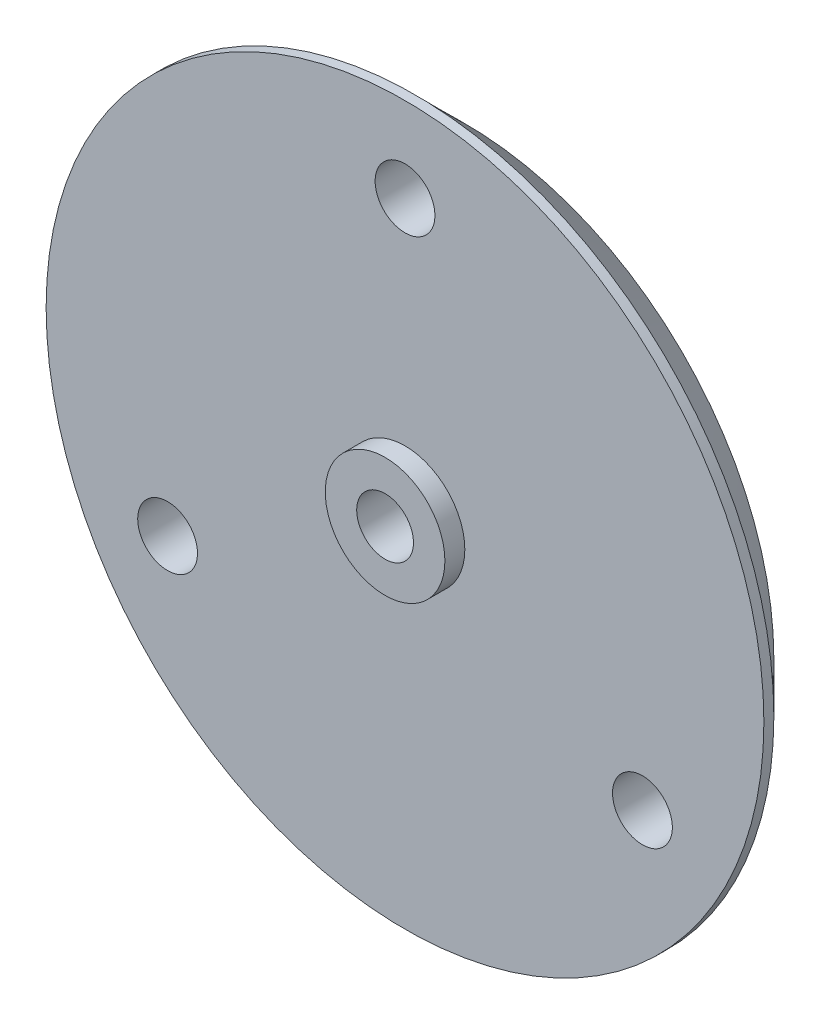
ISO-10303-21;
HEADER;
FILE_DESCRIPTION(('STEP AP214'),'2;1');
FILE_NAME('part.step','',(''),(''),'','','');
FILE_SCHEMA(('AUTOMOTIVE_DESIGN { 1 0 10303 214 1 1 1 1 }'));
ENDSEC;
DATA;
#1=APPLICATION_CONTEXT('core data for automotive mechanical design processes');
#2=APPLICATION_PROTOCOL_DEFINITION('international standard','automotive_design',2000,#1);
#3=PRODUCT_CONTEXT('',#1,'mechanical');
#4=PRODUCT('Part','Part','',(#3));
#5=PRODUCT_RELATED_PRODUCT_CATEGORY('part','',(#4));
#6=PRODUCT_DEFINITION_FORMATION('','',#4);
#7=PRODUCT_DEFINITION_CONTEXT('part definition',#1,'design');
#8=PRODUCT_DEFINITION('design','',#6,#7);
#9=PRODUCT_DEFINITION_SHAPE('','',#8);
#10=(LENGTH_UNIT() NAMED_UNIT(*) SI_UNIT(.MILLI.,.METRE.));
#11=(NAMED_UNIT(*) PLANE_ANGLE_UNIT() SI_UNIT($,.RADIAN.));
#12=(NAMED_UNIT(*) SI_UNIT($,.STERADIAN.) SOLID_ANGLE_UNIT());
#13=UNCERTAINTY_MEASURE_WITH_UNIT(LENGTH_MEASURE(1.E-05),#10,'distance_accuracy_value','');
#14=(GEOMETRIC_REPRESENTATION_CONTEXT(3) GLOBAL_UNCERTAINTY_ASSIGNED_CONTEXT((#13)) GLOBAL_UNIT_ASSIGNED_CONTEXT((#10,
#11,#12)) REPRESENTATION_CONTEXT('',''));
#15=CARTESIAN_POINT('',(0.,0.,0.));
#16=DIRECTION('',(0.,0.,1.));
#17=DIRECTION('',(1.,0.,0.));
#18=AXIS2_PLACEMENT_3D('',#15,#16,#17);
#19=CARTESIAN_POINT('',(0.,0.,3.));
#20=DIRECTION('',(0.,0.,1.));
#21=DIRECTION('',(1.,0.,0.));
#22=AXIS2_PLACEMENT_3D('',#19,#20,#21);
#23=PLANE('',#22);
#24=CARTESIAN_POINT('',(0.,0.,3.));
#25=DIRECTION('',(0.,0.,1.));
#26=DIRECTION('',(1.,0.,0.));
#27=AXIS2_PLACEMENT_3D('',#24,#25,#26);
#28=CIRCLE('',#27,18.);
#29=CARTESIAN_POINT('',(18.,0.,3.));
#30=VERTEX_POINT('',#29);
#31=EDGE_CURVE('E205',#30,#30,#28,.T.);
#32=ORIENTED_EDGE('',*,*,#31,.T.);
#33=EDGE_LOOP('',(#32));
#34=FACE_BOUND('',#33,.T.);
#35=CARTESIAN_POINT('',(0.,13.75,3.));
#36=DIRECTION('',(0.,0.,-1.));
#37=DIRECTION('',(-1.,0.,0.));
#38=AXIS2_PLACEMENT_3D('',#35,#36,#37);
#39=CIRCLE('',#38,1.5);
#40=CARTESIAN_POINT('',(-1.5,13.75,3.));
#41=VERTEX_POINT('',#40);
#42=EDGE_CURVE('E259',#41,#41,#39,.T.);
#43=ORIENTED_EDGE('',*,*,#42,.T.);
#44=EDGE_LOOP('',(#43));
#45=FACE_BOUND('',#44,.T.);
#46=CARTESIAN_POINT('',(11.907849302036,-6.87500000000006,3.));
#47=DIRECTION('',(0.,0.,-1.));
#48=DIRECTION('',(0.500000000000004,0.866025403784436,0.));
#49=AXIS2_PLACEMENT_3D('',#46,#47,#48);
#50=CIRCLE('',#49,1.5);
#51=CARTESIAN_POINT('',(12.657849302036,-5.5759618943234,3.));
#52=VERTEX_POINT('',#51);
#53=EDGE_CURVE('E265',#52,#52,#50,.T.);
#54=ORIENTED_EDGE('',*,*,#53,.T.);
#55=EDGE_LOOP('',(#54));
#56=FACE_BOUND('',#55,.T.);
#57=CARTESIAN_POINT('',(-11.9078493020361,-6.87499999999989,3.));
#58=DIRECTION('',(0.,0.,-1.));
#59=DIRECTION('',(0.499999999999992,-0.866025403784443,0.));
#60=AXIS2_PLACEMENT_3D('',#57,#58,#59);
#61=CIRCLE('',#60,1.5);
#62=CARTESIAN_POINT('',(-11.1578493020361,-8.17403810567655,3.));
#63=VERTEX_POINT('',#62);
#64=EDGE_CURVE('E271',#63,#63,#61,.T.);
#65=ORIENTED_EDGE('',*,*,#64,.T.);
#66=EDGE_LOOP('',(#65));
#67=FACE_BOUND('',#66,.T.);
#68=CARTESIAN_POINT('',(0.,0.,3.));
#69=DIRECTION('',(0.,0.,1.));
#70=DIRECTION('',(1.,0.,0.));
#71=AXIS2_PLACEMENT_3D('',#68,#69,#70);
#72=CIRCLE('',#71,3.);
#73=CARTESIAN_POINT('',(3.,0.,3.));
#74=VERTEX_POINT('',#73);
#75=EDGE_CURVE('E280',#74,#74,#72,.T.);
#76=ORIENTED_EDGE('',*,*,#75,.F.);
#77=EDGE_LOOP('',(#76));
#78=FACE_BOUND('',#77,.T.);
#79=ADVANCED_FACE('F194',(#34,#45,#56,#67,#78),#23,.T.);
#80=CARTESIAN_POINT('',(0.,0.,0.));
#81=DIRECTION('',(0.,0.,1.));
#82=DIRECTION('',(1.,0.,0.));
#83=AXIS2_PLACEMENT_3D('',#80,#81,#82);
#84=PLANE('',#83);
#85=CARTESIAN_POINT('',(0.,0.,0.));
#86=DIRECTION('',(0.,0.,-1.));
#87=DIRECTION('',(-1.,0.,0.));
#88=AXIS2_PLACEMENT_3D('',#85,#86,#87);
#89=CIRCLE('',#88,8.95);
#90=CARTESIAN_POINT('',(-8.95,0.,0.));
#91=VERTEX_POINT('',#90);
#92=EDGE_CURVE('E241',#91,#91,#89,.T.);
#93=ORIENTED_EDGE('',*,*,#92,.F.);
#94=EDGE_LOOP('',(#93));
#95=FACE_BOUND('',#94,.T.);
#96=CARTESIAN_POINT('',(0.,0.,0.));
#97=DIRECTION('',(0.,0.,-1.));
#98=DIRECTION('',(-1.,0.,0.));
#99=AXIS2_PLACEMENT_3D('',#96,#97,#98);
#100=CIRCLE('',#99,10.95);
#101=CARTESIAN_POINT('',(-10.95,0.,0.));
#102=VERTEX_POINT('',#101);
#103=EDGE_CURVE('E247',#102,#102,#100,.T.);
#104=ORIENTED_EDGE('',*,*,#103,.T.);
#105=EDGE_LOOP('',(#104));
#106=FACE_BOUND('',#105,.T.);
#107=ADVANCED_FACE('F315',(#95,#106),#84,.F.);
#108=CARTESIAN_POINT('',(0.,0.,0.));
#109=DIRECTION('',(0.,0.,-1.));
#110=DIRECTION('',(-1.,0.,0.));
#111=AXIS2_PLACEMENT_3D('',#108,#109,#110);
#112=CIRCLE('',#111,6.95);
#113=CARTESIAN_POINT('',(-6.95,0.,0.));
#114=VERTEX_POINT('',#113);
#115=EDGE_CURVE('E229',#114,#114,#112,.T.);
#116=ORIENTED_EDGE('',*,*,#115,.F.);
#117=EDGE_LOOP('',(#116));
#118=FACE_BOUND('',#117,.T.);
#119=CARTESIAN_POINT('',(0.,0.,0.));
#120=DIRECTION('',(0.,0.,-1.));
#121=DIRECTION('',(-1.,0.,0.));
#122=AXIS2_PLACEMENT_3D('',#119,#120,#121);
#123=CIRCLE('',#122,7.95);
#124=CARTESIAN_POINT('',(-7.95,0.,0.));
#125=VERTEX_POINT('',#124);
#126=EDGE_CURVE('E235',#125,#125,#123,.T.);
#127=ORIENTED_EDGE('',*,*,#126,.T.);
#128=EDGE_LOOP('',(#127));
#129=FACE_BOUND('',#128,.T.);
#130=ADVANCED_FACE('F322',(#118,#129),#84,.F.);
#131=CARTESIAN_POINT('',(0.,0.,0.));
#132=DIRECTION('',(0.,0.,-1.));
#133=DIRECTION('',(-1.,0.,0.));
#134=AXIS2_PLACEMENT_3D('',#131,#132,#133);
#135=CIRCLE('',#134,4.95);
#136=CARTESIAN_POINT('',(-4.95,0.,0.));
#137=VERTEX_POINT('',#136);
#138=EDGE_CURVE('E214',#137,#137,#135,.T.);
#139=ORIENTED_EDGE('',*,*,#138,.F.);
#140=EDGE_LOOP('',(#139));
#141=FACE_BOUND('',#140,.T.);
#142=CARTESIAN_POINT('',(0.,0.,0.));
#143=DIRECTION('',(0.,0.,-1.));
#144=DIRECTION('',(-1.,0.,0.));
#145=AXIS2_PLACEMENT_3D('',#142,#143,#144);
#146=CIRCLE('',#145,5.95);
#147=CARTESIAN_POINT('',(-5.95,0.,0.));
#148=VERTEX_POINT('',#147);
#149=EDGE_CURVE('E223',#148,#148,#146,.T.);
#150=ORIENTED_EDGE('',*,*,#149,.T.);
#151=EDGE_LOOP('',(#150));
#152=FACE_BOUND('',#151,.T.);
#153=ADVANCED_FACE('F299',(#141,#152),#84,.F.);
#154=CARTESIAN_POINT('',(0.,0.,1.6));
#155=DIRECTION('',(0.,0.,-1.));
#156=DIRECTION('',(-1.,0.,0.));
#157=AXIS2_PLACEMENT_3D('',#154,#155,#156);
#158=CYLINDRICAL_SURFACE('',#157,4.95);
#159=CARTESIAN_POINT('',(0.,0.,1.6));
#160=DIRECTION('',(0.,0.,-1.));
#161=DIRECTION('',(-1.,0.,0.));
#162=AXIS2_PLACEMENT_3D('',#159,#160,#161);
#163=CIRCLE('',#162,4.95);
#164=CARTESIAN_POINT('',(-4.95,0.,1.6));
#165=VERTEX_POINT('',#164);
#166=EDGE_CURVE('E209',#165,#165,#163,.T.);
#167=ORIENTED_EDGE('',*,*,#166,.F.);
#168=EDGE_LOOP('',(#167));
#169=FACE_BOUND('',#168,.T.);
#170=ORIENTED_EDGE('',*,*,#138,.T.);
#171=EDGE_LOOP('',(#170));
#172=FACE_BOUND('',#171,.T.);
#173=ADVANCED_FACE('F310',(#169,#172),#158,.F.);
#174=CARTESIAN_POINT('',(0.,0.,1.6));
#175=DIRECTION('',(0.,0.,-1.));
#176=DIRECTION('',(-1.,0.,0.));
#177=AXIS2_PLACEMENT_3D('',#174,#175,#176);
#178=PLANE('',#177);
#179=CARTESIAN_POINT('',(0.,0.,1.6));
#180=DIRECTION('',(0.,0.,-1.));
#181=DIRECTION('',(-1.,0.,0.));
#182=AXIS2_PLACEMENT_3D('',#179,#180,#181);
#183=CIRCLE('',#182,3.95);
#184=CARTESIAN_POINT('',(-3.95,0.,1.6));
#185=VERTEX_POINT('',#184);
#186=EDGE_CURVE('E217',#185,#185,#183,.T.);
#187=ORIENTED_EDGE('',*,*,#186,.F.);
#188=EDGE_LOOP('',(#187));
#189=FACE_BOUND('',#188,.T.);
#190=ORIENTED_EDGE('',*,*,#166,.T.);
#191=EDGE_LOOP('',(#190));
#192=FACE_BOUND('',#191,.T.);
#193=ADVANCED_FACE('F303',(#189,#192),#178,.T.);
#194=CARTESIAN_POINT('',(0.,0.,1.6));
#195=DIRECTION('',(0.,0.,-1.));
#196=DIRECTION('',(-1.,0.,0.));
#197=AXIS2_PLACEMENT_3D('',#194,#195,#196);
#198=CYLINDRICAL_SURFACE('',#197,3.95);
#199=ORIENTED_EDGE('',*,*,#186,.T.);
#200=EDGE_LOOP('',(#199));
#201=FACE_BOUND('',#200,.T.);
#202=CARTESIAN_POINT('',(0.,0.,0.));
#203=DIRECTION('',(0.,0.,-1.));
#204=DIRECTION('',(-1.,0.,0.));
#205=AXIS2_PLACEMENT_3D('',#202,#203,#204);
#206=CIRCLE('',#205,3.95);
#207=CARTESIAN_POINT('',(-3.95,0.,0.));
#208=VERTEX_POINT('',#207);
#209=EDGE_CURVE('E220',#208,#208,#206,.T.);
#210=ORIENTED_EDGE('',*,*,#209,.F.);
#211=EDGE_LOOP('',(#210));
#212=FACE_BOUND('',#211,.T.);
#213=ADVANCED_FACE('F296',(#201,#212),#198,.T.);
#214=CARTESIAN_POINT('',(0.,0.,0.));
#215=DIRECTION('',(0.,0.,-1.));
#216=DIRECTION('',(-1.,0.,0.));
#217=AXIS2_PLACEMENT_3D('',#214,#215,#216);
#218=CIRCLE('',#217,1.425);
#219=CARTESIAN_POINT('',(-1.425,0.,0.));
#220=VERTEX_POINT('',#219);
#221=EDGE_CURVE('E286',#220,#220,#218,.T.);
#222=ORIENTED_EDGE('',*,*,#221,.F.);
#223=EDGE_LOOP('',(#222));
#224=FACE_BOUND('',#223,.T.);
#225=ORIENTED_EDGE('',*,*,#209,.T.);
#226=EDGE_LOOP('',(#225));
#227=FACE_BOUND('',#226,.T.);
#228=ADVANCED_FACE('F292',(#224,#227),#84,.F.);
#229=CARTESIAN_POINT('',(0.,0.,1.6));
#230=DIRECTION('',(0.,0.,-1.));
#231=DIRECTION('',(-1.,0.,0.));
#232=AXIS2_PLACEMENT_3D('',#229,#230,#231);
#233=CYLINDRICAL_SURFACE('',#232,6.95);
#234=CARTESIAN_POINT('',(0.,0.,1.6));
#235=DIRECTION('',(0.,0.,-1.));
#236=DIRECTION('',(-1.,0.,0.));
#237=AXIS2_PLACEMENT_3D('',#234,#235,#236);
#238=CIRCLE('',#237,6.95);
#239=CARTESIAN_POINT('',(-6.95,0.,1.6));
#240=VERTEX_POINT('',#239);
#241=EDGE_CURVE('E232',#240,#240,#238,.T.);
#242=ORIENTED_EDGE('',*,*,#241,.F.);
#243=EDGE_LOOP('',(#242));
#244=FACE_BOUND('',#243,.T.);
#245=ORIENTED_EDGE('',*,*,#115,.T.);
#246=EDGE_LOOP('',(#245));
#247=FACE_BOUND('',#246,.T.);
#248=ADVANCED_FACE('F295',(#244,#247),#233,.F.);
#249=CARTESIAN_POINT('',(0.,0.,1.6));
#250=DIRECTION('',(0.,0.,-1.));
#251=DIRECTION('',(-1.,0.,0.));
#252=AXIS2_PLACEMENT_3D('',#249,#250,#251);
#253=PLANE('',#252);
#254=CARTESIAN_POINT('',(0.,0.,1.6));
#255=DIRECTION('',(0.,0.,-1.));
#256=DIRECTION('',(-1.,0.,0.));
#257=AXIS2_PLACEMENT_3D('',#254,#255,#256);
#258=CIRCLE('',#257,5.95);
#259=CARTESIAN_POINT('',(-5.95,0.,1.6));
#260=VERTEX_POINT('',#259);
#261=EDGE_CURVE('E226',#260,#260,#258,.T.);
#262=ORIENTED_EDGE('',*,*,#261,.F.);
#263=EDGE_LOOP('',(#262));
#264=FACE_BOUND('',#263,.T.);
#265=ORIENTED_EDGE('',*,*,#241,.T.);
#266=EDGE_LOOP('',(#265));
#267=FACE_BOUND('',#266,.T.);
#268=ADVANCED_FACE('F348',(#264,#267),#253,.T.);
#269=CARTESIAN_POINT('',(0.,0.,1.6));
#270=DIRECTION('',(0.,0.,-1.));
#271=DIRECTION('',(-1.,0.,0.));
#272=AXIS2_PLACEMENT_3D('',#269,#270,#271);
#273=CYLINDRICAL_SURFACE('',#272,5.95);
#274=ORIENTED_EDGE('',*,*,#261,.T.);
#275=EDGE_LOOP('',(#274));
#276=FACE_BOUND('',#275,.T.);
#277=ORIENTED_EDGE('',*,*,#149,.F.);
#278=EDGE_LOOP('',(#277));
#279=FACE_BOUND('',#278,.T.);
#280=ADVANCED_FACE('F345',(#276,#279),#273,.T.);
#281=CARTESIAN_POINT('',(0.,0.,1.6));
#282=DIRECTION('',(0.,0.,-1.));
#283=DIRECTION('',(-1.,0.,0.));
#284=AXIS2_PLACEMENT_3D('',#281,#282,#283);
#285=CYLINDRICAL_SURFACE('',#284,8.95);
#286=CARTESIAN_POINT('',(0.,0.,1.6));
#287=DIRECTION('',(0.,0.,-1.));
#288=DIRECTION('',(-1.,0.,0.));
#289=AXIS2_PLACEMENT_3D('',#286,#287,#288);
#290=CIRCLE('',#289,8.95);
#291=CARTESIAN_POINT('',(-8.95,0.,1.6));
#292=VERTEX_POINT('',#291);
#293=EDGE_CURVE('E244',#292,#292,#290,.T.);
#294=ORIENTED_EDGE('',*,*,#293,.F.);
#295=EDGE_LOOP('',(#294));
#296=FACE_BOUND('',#295,.T.);
#297=ORIENTED_EDGE('',*,*,#92,.T.);
#298=EDGE_LOOP('',(#297));
#299=FACE_BOUND('',#298,.T.);
#300=ADVANCED_FACE('F347',(#296,#299),#285,.F.);
#301=CARTESIAN_POINT('',(0.,0.,1.6));
#302=DIRECTION('',(0.,0.,-1.));
#303=DIRECTION('',(-1.,0.,0.));
#304=AXIS2_PLACEMENT_3D('',#301,#302,#303);
#305=PLANE('',#304);
#306=CARTESIAN_POINT('',(0.,0.,1.6));
#307=DIRECTION('',(0.,0.,-1.));
#308=DIRECTION('',(-1.,0.,0.));
#309=AXIS2_PLACEMENT_3D('',#306,#307,#308);
#310=CIRCLE('',#309,7.95);
#311=CARTESIAN_POINT('',(-7.95,0.,1.6));
#312=VERTEX_POINT('',#311);
#313=EDGE_CURVE('E238',#312,#312,#310,.T.);
#314=ORIENTED_EDGE('',*,*,#313,.F.);
#315=EDGE_LOOP('',(#314));
#316=FACE_BOUND('',#315,.T.);
#317=ORIENTED_EDGE('',*,*,#293,.T.);
#318=EDGE_LOOP('',(#317));
#319=FACE_BOUND('',#318,.T.);
#320=ADVANCED_FACE('F354',(#316,#319),#305,.T.);
#321=CARTESIAN_POINT('',(0.,0.,1.6));
#322=DIRECTION('',(0.,0.,-1.));
#323=DIRECTION('',(-1.,0.,0.));
#324=AXIS2_PLACEMENT_3D('',#321,#322,#323);
#325=CYLINDRICAL_SURFACE('',#324,7.95);
#326=ORIENTED_EDGE('',*,*,#313,.T.);
#327=EDGE_LOOP('',(#326));
#328=FACE_BOUND('',#327,.T.);
#329=ORIENTED_EDGE('',*,*,#126,.F.);
#330=EDGE_LOOP('',(#329));
#331=FACE_BOUND('',#330,.T.);
#332=ADVANCED_FACE('F362',(#328,#331),#325,.T.);
#333=CARTESIAN_POINT('',(0.,0.,1.6));
#334=DIRECTION('',(0.,0.,-1.));
#335=DIRECTION('',(-1.,0.,0.));
#336=AXIS2_PLACEMENT_3D('',#333,#334,#335);
#337=CYLINDRICAL_SURFACE('',#336,11.95);
#338=CARTESIAN_POINT('',(0.,0.,1.6));
#339=DIRECTION('',(0.,0.,-1.));
#340=DIRECTION('',(-1.,0.,0.));
#341=AXIS2_PLACEMENT_3D('',#338,#339,#340);
#342=CIRCLE('',#341,11.95);
#343=CARTESIAN_POINT('',(-11.95,0.,1.6));
#344=VERTEX_POINT('',#343);
#345=EDGE_CURVE('E256',#344,#344,#342,.T.);
#346=ORIENTED_EDGE('',*,*,#345,.F.);
#347=EDGE_LOOP('',(#346));
#348=FACE_BOUND('',#347,.T.);
#349=CARTESIAN_POINT('',(0.,0.,0.));
#350=DIRECTION('',(0.,0.,-1.));
#351=DIRECTION('',(-1.,0.,0.));
#352=AXIS2_PLACEMENT_3D('',#349,#350,#351);
#353=CIRCLE('',#352,11.95);
#354=CARTESIAN_POINT('',(-11.95,0.,0.));
#355=VERTEX_POINT('',#354);
#356=EDGE_CURVE('E253',#355,#355,#353,.T.);
#357=ORIENTED_EDGE('',*,*,#356,.T.);
#358=EDGE_LOOP('',(#357));
#359=FACE_BOUND('',#358,.T.);
#360=ADVANCED_FACE('F365',(#348,#359),#337,.F.);
#361=CARTESIAN_POINT('',(0.,0.,1.6));
#362=DIRECTION('',(0.,0.,-1.));
#363=DIRECTION('',(-1.,0.,0.));
#364=AXIS2_PLACEMENT_3D('',#361,#362,#363);
#365=PLANE('',#364);
#366=CARTESIAN_POINT('',(0.,0.,1.6));
#367=DIRECTION('',(0.,0.,-1.));
#368=DIRECTION('',(-1.,0.,0.));
#369=AXIS2_PLACEMENT_3D('',#366,#367,#368);
#370=CIRCLE('',#369,10.95);
#371=CARTESIAN_POINT('',(-10.95,0.,1.6));
#372=VERTEX_POINT('',#371);
#373=EDGE_CURVE('E250',#372,#372,#370,.T.);
#374=ORIENTED_EDGE('',*,*,#373,.F.);
#375=EDGE_LOOP('',(#374));
#376=FACE_BOUND('',#375,.T.);
#377=ORIENTED_EDGE('',*,*,#345,.T.);
#378=EDGE_LOOP('',(#377));
#379=FACE_BOUND('',#378,.T.);
#380=ADVANCED_FACE('F373',(#376,#379),#365,.T.);
#381=CARTESIAN_POINT('',(0.,0.,1.6));
#382=DIRECTION('',(0.,0.,-1.));
#383=DIRECTION('',(-1.,0.,0.));
#384=AXIS2_PLACEMENT_3D('',#381,#382,#383);
#385=CYLINDRICAL_SURFACE('',#384,10.95);
#386=ORIENTED_EDGE('',*,*,#373,.T.);
#387=EDGE_LOOP('',(#386));
#388=FACE_BOUND('',#387,.T.);
#389=ORIENTED_EDGE('',*,*,#103,.F.);
#390=EDGE_LOOP('',(#389));
#391=FACE_BOUND('',#390,.T.);
#392=ADVANCED_FACE('F370',(#388,#391),#385,.T.);
#393=CARTESIAN_POINT('',(0.,0.,3.));
#394=DIRECTION('',(0.,0.,-1.));
#395=DIRECTION('',(-1.,0.,0.));
#396=AXIS2_PLACEMENT_3D('',#393,#394,#395);
#397=CYLINDRICAL_SURFACE('',#396,18.);
#398=CARTESIAN_POINT('',(0.,0.,2.50000000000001));
#399=DIRECTION('',(0.,0.,1.));
#400=DIRECTION('',(1.,0.,0.));
#401=AXIS2_PLACEMENT_3D('',#398,#399,#400);
#402=CIRCLE('',#401,18.);
#403=CARTESIAN_POINT('',(18.,0.,2.50000000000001));
#404=VERTEX_POINT('',#403);
#405=EDGE_CURVE('E201',#404,#404,#402,.T.);
#406=ORIENTED_EDGE('',*,*,#405,.T.);
#407=EDGE_LOOP('',(#406));
#408=FACE_BOUND('',#407,.T.);
#409=ORIENTED_EDGE('',*,*,#31,.F.);
#410=EDGE_LOOP('',(#409));
#411=FACE_BOUND('',#410,.T.);
#412=ADVANCED_FACE('F196',(#408,#411),#397,.T.);
#413=CARTESIAN_POINT('',(0.,0.,2.50000000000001));
#414=DIRECTION('',(0.,0.,1.));
#415=DIRECTION('',(1.,0.,0.));
#416=AXIS2_PLACEMENT_3D('',#413,#414,#415);
#417=CONICAL_SURFACE('',#416,18.,0.78539816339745);
#418=CARTESIAN_POINT('',(0.,0.,0.));
#419=DIRECTION('',(0.,0.,1.));
#420=DIRECTION('',(1.,0.,0.));
#421=AXIS2_PLACEMENT_3D('',#418,#419,#420);
#422=CIRCLE('',#421,15.5);
#423=CARTESIAN_POINT('',(15.5,0.,0.));
#424=VERTEX_POINT('',#423);
#425=EDGE_CURVE('E11',#424,#424,#422,.F.);
#426=ORIENTED_EDGE('',*,*,#425,.F.);
#427=EDGE_LOOP('',(#426));
#428=FACE_BOUND('',#427,.T.);
#429=ORIENTED_EDGE('',*,*,#405,.F.);
#430=EDGE_LOOP('',(#429));
#431=FACE_BOUND('',#430,.T.);
#432=ADVANCED_FACE('F328',(#428,#431),#417,.T.);
#433=CARTESIAN_POINT('',(-11.9078493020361,-6.87499999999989,0.));
#434=DIRECTION('',(0.,0.,-1.));
#435=DIRECTION('',(0.499999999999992,-0.866025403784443,0.));
#436=AXIS2_PLACEMENT_3D('',#433,#434,#435);
#437=CIRCLE('',#436,1.5);
#438=CARTESIAN_POINT('',(-11.1578493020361,-8.17403810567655,0.));
#439=VERTEX_POINT('',#438);
#440=EDGE_CURVE('E274',#439,#439,#437,.T.);
#441=ORIENTED_EDGE('',*,*,#440,.F.);
#442=EDGE_LOOP('',(#441));
#443=FACE_BOUND('',#442,.T.);
#444=CARTESIAN_POINT('',(11.907849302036,-6.87500000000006,0.));
#445=DIRECTION('',(0.,0.,-1.));
#446=DIRECTION('',(0.500000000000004,0.866025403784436,0.));
#447=AXIS2_PLACEMENT_3D('',#444,#445,#446);
#448=CIRCLE('',#447,1.5);
#449=CARTESIAN_POINT('',(12.657849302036,-5.5759618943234,0.));
#450=VERTEX_POINT('',#449);
#451=EDGE_CURVE('E268',#450,#450,#448,.T.);
#452=ORIENTED_EDGE('',*,*,#451,.F.);
#453=EDGE_LOOP('',(#452));
#454=FACE_BOUND('',#453,.T.);
#455=CARTESIAN_POINT('',(0.,13.75,0.));
#456=DIRECTION('',(0.,0.,-1.));
#457=DIRECTION('',(-1.,0.,0.));
#458=AXIS2_PLACEMENT_3D('',#455,#456,#457);
#459=CIRCLE('',#458,1.5);
#460=CARTESIAN_POINT('',(-1.5,13.75,0.));
#461=VERTEX_POINT('',#460);
#462=EDGE_CURVE('E262',#461,#461,#459,.T.);
#463=ORIENTED_EDGE('',*,*,#462,.F.);
#464=EDGE_LOOP('',(#463));
#465=FACE_BOUND('',#464,.T.);
#466=ORIENTED_EDGE('',*,*,#356,.F.);
#467=EDGE_LOOP('',(#466));
#468=FACE_BOUND('',#467,.T.);
#469=ORIENTED_EDGE('',*,*,#425,.T.);
#470=EDGE_LOOP('',(#469));
#471=FACE_BOUND('',#470,.T.);
#472=ADVANCED_FACE('F298',(#443,#454,#465,#468,#471),#84,.F.);
#473=CARTESIAN_POINT('',(0.,13.75,3.));
#474=DIRECTION('',(0.,0.,-1.));
#475=DIRECTION('',(-1.,0.,0.));
#476=AXIS2_PLACEMENT_3D('',#473,#474,#475);
#477=CYLINDRICAL_SURFACE('',#476,1.5);
#478=ORIENTED_EDGE('',*,*,#42,.F.);
#479=EDGE_LOOP('',(#478));
#480=FACE_BOUND('',#479,.T.);
#481=ORIENTED_EDGE('',*,*,#462,.T.);
#482=EDGE_LOOP('',(#481));
#483=FACE_BOUND('',#482,.T.);
#484=ADVANCED_FACE('F327',(#480,#483),#477,.F.);
#485=CARTESIAN_POINT('',(11.907849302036,-6.87500000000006,3.));
#486=DIRECTION('',(0.,0.,-1.));
#487=DIRECTION('',(-1.,0.,0.));
#488=AXIS2_PLACEMENT_3D('',#485,#486,#487);
#489=CYLINDRICAL_SURFACE('',#488,1.5);
#490=ORIENTED_EDGE('',*,*,#53,.F.);
#491=EDGE_LOOP('',(#490));
#492=FACE_BOUND('',#491,.T.);
#493=ORIENTED_EDGE('',*,*,#451,.T.);
#494=EDGE_LOOP('',(#493));
#495=FACE_BOUND('',#494,.T.);
#496=ADVANCED_FACE('F383',(#492,#495),#489,.F.);
#497=CARTESIAN_POINT('',(-11.9078493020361,-6.87499999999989,3.));
#498=DIRECTION('',(0.,0.,-1.));
#499=DIRECTION('',(-1.,0.,0.));
#500=AXIS2_PLACEMENT_3D('',#497,#498,#499);
#501=CYLINDRICAL_SURFACE('',#500,1.5);
#502=ORIENTED_EDGE('',*,*,#64,.F.);
#503=EDGE_LOOP('',(#502));
#504=FACE_BOUND('',#503,.T.);
#505=ORIENTED_EDGE('',*,*,#440,.T.);
#506=EDGE_LOOP('',(#505));
#507=FACE_BOUND('',#506,.T.);
#508=ADVANCED_FACE('F387',(#504,#507),#501,.F.);
#509=CARTESIAN_POINT('',(0.,0.,4.));
#510=DIRECTION('',(0.,0.,-1.));
#511=DIRECTION('',(-1.,0.,0.));
#512=AXIS2_PLACEMENT_3D('',#509,#510,#511);
#513=CYLINDRICAL_SURFACE('',#512,3.);
#514=CARTESIAN_POINT('',(0.,0.,4.));
#515=DIRECTION('',(0.,0.,1.));
#516=DIRECTION('',(1.,0.,0.));
#517=AXIS2_PLACEMENT_3D('',#514,#515,#516);
#518=CIRCLE('',#517,3.);
#519=CARTESIAN_POINT('',(3.,0.,4.));
#520=VERTEX_POINT('',#519);
#521=EDGE_CURVE('E277',#520,#520,#518,.T.);
#522=ORIENTED_EDGE('',*,*,#521,.F.);
#523=EDGE_LOOP('',(#522));
#524=FACE_BOUND('',#523,.T.);
#525=ORIENTED_EDGE('',*,*,#75,.T.);
#526=EDGE_LOOP('',(#525));
#527=FACE_BOUND('',#526,.T.);
#528=ADVANCED_FACE('F390',(#524,#527),#513,.T.);
#529=CARTESIAN_POINT('',(0.,0.,4.));
#530=DIRECTION('',(0.,0.,1.));
#531=DIRECTION('',(1.,0.,0.));
#532=AXIS2_PLACEMENT_3D('',#529,#530,#531);
#533=PLANE('',#532);
#534=CARTESIAN_POINT('',(0.,0.,4.));
#535=DIRECTION('',(0.,0.,-1.));
#536=DIRECTION('',(-1.,0.,0.));
#537=AXIS2_PLACEMENT_3D('',#534,#535,#536);
#538=CIRCLE('',#537,1.425);
#539=CARTESIAN_POINT('',(-1.425,0.,4.));
#540=VERTEX_POINT('',#539);
#541=EDGE_CURVE('E283',#540,#540,#538,.T.);
#542=ORIENTED_EDGE('',*,*,#541,.T.);
#543=EDGE_LOOP('',(#542));
#544=FACE_BOUND('',#543,.T.);
#545=ORIENTED_EDGE('',*,*,#521,.T.);
#546=EDGE_LOOP('',(#545));
#547=FACE_BOUND('',#546,.T.);
#548=ADVANCED_FACE('F393',(#544,#547),#533,.T.);
#549=CARTESIAN_POINT('',(0.,0.,4.));
#550=DIRECTION('',(0.,0.,-1.));
#551=DIRECTION('',(-1.,0.,0.));
#552=AXIS2_PLACEMENT_3D('',#549,#550,#551);
#553=CYLINDRICAL_SURFACE('',#552,1.425);
#554=ORIENTED_EDGE('',*,*,#541,.F.);
#555=EDGE_LOOP('',(#554));
#556=FACE_BOUND('',#555,.T.);
#557=ORIENTED_EDGE('',*,*,#221,.T.);
#558=EDGE_LOOP('',(#557));
#559=FACE_BOUND('',#558,.T.);
#560=ADVANCED_FACE('F290',(#556,#559),#553,.F.);
#561=CLOSED_SHELL('',(#79,#107,#130,#153,#173,#193,#213,#228,#248,#268,#280,#300,#320,#332,#360,
#380,#392,#412,#432,#472,#484,#496,#508,#528,#548,#560));
#562=MANIFOLD_SOLID_BREP('B2',#561);
#563=ADVANCED_BREP_SHAPE_REPRESENTATION('',(#18,#562),#14);
#564=SHAPE_DEFINITION_REPRESENTATION(#9,#563);
ENDSEC;
END-ISO-10303-21;
